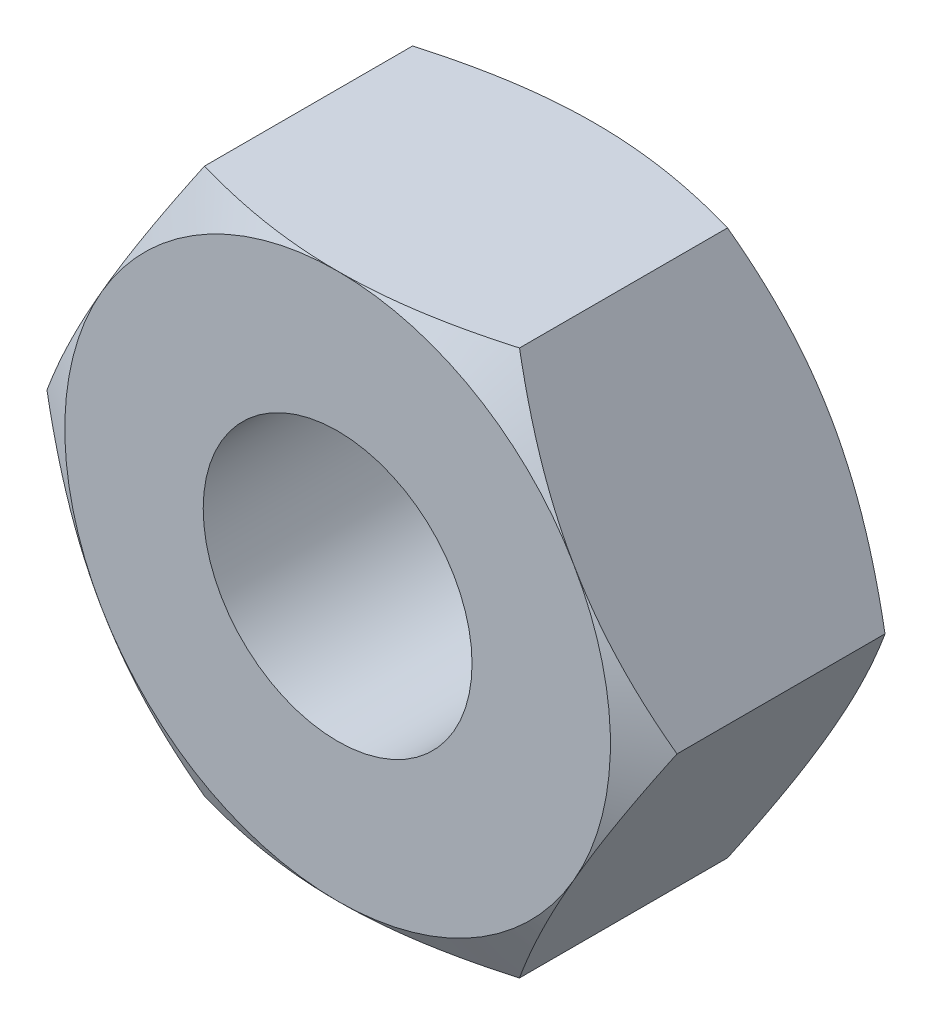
ISO-10303-21;
HEADER;
FILE_DESCRIPTION(('STEP AP214'),'2;1');
FILE_NAME('part.step','',(''),(''),'','','');
FILE_SCHEMA(('AUTOMOTIVE_DESIGN { 1 0 10303 214 1 1 1 1 }'));
ENDSEC;
DATA;
#1=APPLICATION_CONTEXT('core data for automotive mechanical design processes');
#2=APPLICATION_PROTOCOL_DEFINITION('international standard','automotive_design',2000,#1);
#3=PRODUCT_CONTEXT('',#1,'mechanical');
#4=PRODUCT('Part','Part','',(#3));
#5=PRODUCT_RELATED_PRODUCT_CATEGORY('part','',(#4));
#6=PRODUCT_DEFINITION_FORMATION('','',#4);
#7=PRODUCT_DEFINITION_CONTEXT('part definition',#1,'design');
#8=PRODUCT_DEFINITION('design','',#6,#7);
#9=PRODUCT_DEFINITION_SHAPE('','',#8);
#10=(LENGTH_UNIT() NAMED_UNIT(*) SI_UNIT(.MILLI.,.METRE.));
#11=(NAMED_UNIT(*) PLANE_ANGLE_UNIT() SI_UNIT($,.RADIAN.));
#12=(NAMED_UNIT(*) SI_UNIT($,.STERADIAN.) SOLID_ANGLE_UNIT());
#13=UNCERTAINTY_MEASURE_WITH_UNIT(LENGTH_MEASURE(1.E-05),#10,'distance_accuracy_value','');
#14=(GEOMETRIC_REPRESENTATION_CONTEXT(3) GLOBAL_UNCERTAINTY_ASSIGNED_CONTEXT((#13)) GLOBAL_UNIT_ASSIGNED_CONTEXT((#10,
#11,#12)) REPRESENTATION_CONTEXT('',''));
#15=CARTESIAN_POINT('',(0.,0.,0.));
#16=DIRECTION('',(0.,0.,1.));
#17=DIRECTION('',(1.,0.,0.));
#18=AXIS2_PLACEMENT_3D('',#15,#16,#17);
#19=CARTESIAN_POINT('',(0.,0.,-7.23625548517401));
#20=DIRECTION('',(0.,0.,1.));
#21=DIRECTION('',(0.,-1.,0.));
#22=AXIS2_PLACEMENT_3D('',#19,#20,#21);
#23=CONICAL_SURFACE('',#22,9.82284430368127,1.0471975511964);
#24=CARTESIAN_POINT('',(0.,8.5,-8.0000000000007));
#25=CARTESIAN_POINT('',(-0.208294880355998,8.5,-8.00003473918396));
#26=CARTESIAN_POINT('',(-0.416579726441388,8.5,-7.9955803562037));
#27=CARTESIAN_POINT('',(-0.832740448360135,8.5,-7.97795154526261));
#28=CARTESIAN_POINT('',(-1.04061639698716,8.5,-7.96477884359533));
#29=CARTESIAN_POINT('',(-1.4546166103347,8.5,-7.93005833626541));
#30=CARTESIAN_POINT('',(-1.66074443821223,8.5,-7.90855269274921));
#31=CARTESIAN_POINT('',(-2.07201802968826,8.5,-7.85762889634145));
#32=CARTESIAN_POINT('',(-2.27716376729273,8.5,-7.82821053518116));
#33=CARTESIAN_POINT('',(-2.89027749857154,8.5,-7.72899518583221));
#34=CARTESIAN_POINT('',(-3.29646437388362,8.5,-7.64818975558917));
#35=CARTESIAN_POINT('',(-4.10534509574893,8.5,-7.46183176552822));
#36=CARTESIAN_POINT('',(-4.50801072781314,8.5,-7.35615561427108));
#37=CARTESIAN_POINT('',(-4.90747728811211,8.5,-7.24081062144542));
#38=B_SPLINE_CURVE_WITH_KNOTS('',3,(#24,#25,#26,#27,#28,#29,#30,#31,#32,#33,#34,#35,#36,#37),
.UNSPECIFIED.,.F.,.F.,(4,2,2,2,2,2,4),(0.,0.624820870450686,1.24951805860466,1.87109489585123,
2.49268809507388,3.73424531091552,4.98210763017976),.UNSPECIFIED.);
#39=CARTESIAN_POINT('',(0.,8.50000000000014,-8.00000000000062));
#40=VERTEX_POINT('',#39);
#41=CARTESIAN_POINT('',(-4.90747728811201,8.50000000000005,-7.24081062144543));
#42=VERTEX_POINT('',#41);
#43=EDGE_CURVE('E145',#40,#42,#38,.T.);
#44=ORIENTED_EDGE('',*,*,#43,.F.);
#45=CARTESIAN_POINT('',(0.,0.,-8.00000000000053));
#46=DIRECTION('',(0.,0.,1.));
#47=DIRECTION('',(0.,-1.,0.));
#48=AXIS2_PLACEMENT_3D('',#45,#46,#47);
#49=CIRCLE('',#48,8.5000000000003);
#50=CARTESIAN_POINT('',(-7.36121593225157,4.24999999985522,-8.00000000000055));
#51=VERTEX_POINT('',#50);
#52=EDGE_CURVE('E147',#51,#40,#49,.F.);
#53=ORIENTED_EDGE('',*,*,#52,.F.);
#54=CARTESIAN_POINT('',(-4.90747728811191,8.50000000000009,-7.24081062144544));
#55=CARTESIAN_POINT('',(-5.10721056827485,8.1540518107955,-7.35615561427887));
#56=CARTESIAN_POINT('',(-5.30854338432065,7.80533314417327,-7.46183176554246));
#57=CARTESIAN_POINT('',(-5.71298374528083,7.10482189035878,-7.64818975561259));
#58=CARTESIAN_POINT('',(-5.91607718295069,6.75305373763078,-7.72899518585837));
#59=CARTESIAN_POINT('',(-6.22263404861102,6.22208167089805,-7.828210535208));
#60=CARTESIAN_POINT('',(-6.32520691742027,6.04442025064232,-7.85762889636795));
#61=CARTESIAN_POINT('',(-6.53084371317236,5.68824687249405,-7.90855269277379));
#62=CARTESIAN_POINT('',(-6.63390762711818,5.50973493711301,-7.93005833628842));
#63=CARTESIAN_POINT('',(-6.84090773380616,5.15120023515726,-7.96477884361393));
#64=CARTESIAN_POINT('',(-6.94484570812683,4.97117438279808,-7.97795154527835));
#65=CARTESIAN_POINT('',(-7.15292606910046,4.61076862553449,-7.99558035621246));
#66=CARTESIAN_POINT('',(-7.25706849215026,4.43038865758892,-8.00003473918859));
#67=CARTESIAN_POINT('',(-7.36121593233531,4.24999999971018,-8.00000000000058));
#68=B_SPLINE_CURVE_WITH_KNOTS('',3,(#54,#55,#56,#57,#58,#59,#60,#61,#62,#63,#64,#65,#66,#67),
.UNSPECIFIED.,.F.,.F.,(4,2,2,2,2,2,4),(0.,1.24786231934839,2.48941953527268,3.11101273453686,
3.73258957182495,4.35728676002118,4.98210763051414),.UNSPECIFIED.);
#69=EDGE_CURVE('E134',#42,#51,#68,.T.);
#70=ORIENTED_EDGE('',*,*,#69,.F.);
#71=EDGE_LOOP('',(#44,#53,#70));
#72=FACE_BOUND('',#71,.T.);
#73=ADVANCED_FACE('F41',(#72),#23,.T.);
#74=CARTESIAN_POINT('',(0.,0.,-7.23625548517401));
#75=DIRECTION('',(0.,0.,1.));
#76=DIRECTION('',(1.,0.,0.));
#77=AXIS2_PLACEMENT_3D('',#74,#75,#76);
#78=CONICAL_SURFACE('',#77,9.82284430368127,1.0471975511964);
#79=CARTESIAN_POINT('',(7.36121593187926,4.25000000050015,-8.00000000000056));
#80=CARTESIAN_POINT('',(7.25706849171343,4.4303886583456,-8.00003473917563));
#81=CARTESIAN_POINT('',(7.15292606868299,4.61076862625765,-7.99558035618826));
#82=CARTESIAN_POINT('',(6.94484570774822,4.97117438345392,-7.97795154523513));
#83=CARTESIAN_POINT('',(6.84090773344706,5.15120023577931,-7.96477884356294));
#84=CARTESIAN_POINT('',(6.6339076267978,5.50973493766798,-7.93005833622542));
#85=CARTESIAN_POINT('',(6.5308437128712,5.68824687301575,-7.90855269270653));
#86=CARTESIAN_POINT('',(6.32520691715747,6.04442025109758,-7.8576288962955));
#87=CARTESIAN_POINT('',(6.22263404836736,6.22208167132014,-7.82821053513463));
#88=CARTESIAN_POINT('',(5.91607718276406,6.7530537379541,-7.72899518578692));
#89=CARTESIAN_POINT('',(5.71298374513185,7.10482189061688,-7.64818975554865));
#90=CARTESIAN_POINT('',(5.30854338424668,7.80533314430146,-7.46183176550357));
#91=CARTESIAN_POINT('',(5.10721056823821,8.15405181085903,-7.35615561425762));
#92=CARTESIAN_POINT('',(4.90747728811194,8.5000000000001,-7.24081062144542));
#93=B_SPLINE_CURVE_WITH_KNOTS('',3,(#79,#80,#81,#82,#83,#84,#85,#86,#87,#88,#89,#90,#91,#92),
.UNSPECIFIED.,.F.,.F.,(4,2,2,2,2,2,4),(0.,0.62482087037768,1.24951805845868,1.87109489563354,
2.49268809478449,3.73424531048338,4.98210762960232),.UNSPECIFIED.);
#94=CARTESIAN_POINT('',(7.36121593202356,4.25000000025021,-8.00000000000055));
#95=VERTEX_POINT('',#94);
#96=CARTESIAN_POINT('',(4.90747728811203,8.50000000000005,-7.24081062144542));
#97=VERTEX_POINT('',#96);
#98=EDGE_CURVE('E211',#95,#97,#93,.T.);
#99=ORIENTED_EDGE('',*,*,#98,.F.);
#100=CARTESIAN_POINT('',(0.,0.,-8.00000000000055));
#101=DIRECTION('',(0.,0.,1.));
#102=DIRECTION('',(1.,0.,0.));
#103=AXIS2_PLACEMENT_3D('',#100,#101,#102);
#104=CIRCLE('',#103,8.50000000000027);
#105=EDGE_CURVE('E152',#40,#95,#104,.F.);
#106=ORIENTED_EDGE('',*,*,#105,.F.);
#107=CARTESIAN_POINT('',(4.90747728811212,8.5,-7.24081062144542));
#108=CARTESIAN_POINT('',(4.50801072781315,8.5,-7.35615561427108));
#109=CARTESIAN_POINT('',(4.10534509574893,8.5,-7.46183176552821));
#110=CARTESIAN_POINT('',(3.29646437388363,8.5,-7.64818975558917));
#111=CARTESIAN_POINT('',(2.89027749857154,8.5,-7.72899518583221));
#112=CARTESIAN_POINT('',(2.27716376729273,8.5,-7.82821053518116));
#113=CARTESIAN_POINT('',(2.07201802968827,8.5,-7.85762889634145));
#114=CARTESIAN_POINT('',(1.66074443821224,8.5,-7.9085526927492));
#115=CARTESIAN_POINT('',(1.45461661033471,8.5,-7.9300583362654));
#116=CARTESIAN_POINT('',(1.04061639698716,8.5,-7.96477884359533));
#117=CARTESIAN_POINT('',(0.832740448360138,8.5,-7.97795154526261));
#118=CARTESIAN_POINT('',(0.41657972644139,8.5,-7.99558035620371));
#119=CARTESIAN_POINT('',(0.208294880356,8.5,-8.00003473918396));
#120=CARTESIAN_POINT('',(0.,8.5,-8.0000000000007));
#121=B_SPLINE_CURVE_WITH_KNOTS('',3,(#107,#108,#109,#110,#111,#112,#113,#114,#115,#116,#117,
#118,#119,#120),.UNSPECIFIED.,.F.,.F.,(4,2,2,2,2,2,4),(0.,1.24786231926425,2.48941953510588,
3.11101273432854,3.73258957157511,4.35728675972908,4.98210763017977),.UNSPECIFIED.);
#122=EDGE_CURVE('E216',#97,#40,#121,.T.);
#123=ORIENTED_EDGE('',*,*,#122,.F.);
#124=EDGE_LOOP('',(#99,#106,#123));
#125=FACE_BOUND('',#124,.T.);
#126=ADVANCED_FACE('F572',(#125),#78,.T.);
#127=CARTESIAN_POINT('',(0.,0.,-7.23625548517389));
#128=DIRECTION('',(0.,0.,1.));
#129=DIRECTION('',(1.,0.,0.));
#130=AXIS2_PLACEMENT_3D('',#127,#128,#129);
#131=CONICAL_SURFACE('',#130,9.82284430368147,1.0471975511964);
#132=CARTESIAN_POINT('',(9.81495457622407,0.,-7.24081062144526));
#133=CARTESIAN_POINT('',(9.61522129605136,0.345948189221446,-7.35615561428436));
#134=CARTESIAN_POINT('',(9.41388847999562,0.694666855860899,-7.46183176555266));
#135=CARTESIAN_POINT('',(9.00944811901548,1.39517810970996,-7.64818975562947));
#136=CARTESIAN_POINT('',(8.8063546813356,1.74694626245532,-7.72899518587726));
#137=CARTESIAN_POINT('',(8.49979781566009,2.27791832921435,-7.82821053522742));
#138=CARTESIAN_POINT('',(8.39722494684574,2.4555797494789,-7.85762889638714));
#139=CARTESIAN_POINT('',(8.19158815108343,2.81175312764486,-7.90855269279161));
#140=CARTESIAN_POINT('',(8.08852423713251,2.99026506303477,-7.93005833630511));
#141=CARTESIAN_POINT('',(7.88152413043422,3.34879976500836,-7.96477884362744));
#142=CARTESIAN_POINT('',(7.77758615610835,3.52882561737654,-7.9779515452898));
#143=CARTESIAN_POINT('',(7.56950579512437,3.88923137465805,-7.99558035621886));
#144=CARTESIAN_POINT('',(7.46536337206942,4.06961134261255,-8.000034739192));
#145=CARTESIAN_POINT('',(7.36121593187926,4.25000000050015,-8.00000000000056));
#146=B_SPLINE_CURVE_WITH_KNOTS('',3,(#132,#133,#134,#135,#136,#137,#138,#139,#140,#141,#142,
#143,#144,#145),.UNSPECIFIED.,.F.,.F.,(4,2,2,2,2,2,4),(0.,1.24786231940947,2.48941953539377,
3.11101273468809,3.73258957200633,4.35728676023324,4.98210763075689),.UNSPECIFIED.);
#147=CARTESIAN_POINT('',(9.81495457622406,0.,-7.24081062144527));
#148=VERTEX_POINT('',#147);
#149=EDGE_CURVE('E210',#148,#95,#146,.T.);
#150=ORIENTED_EDGE('',*,*,#149,.F.);
#151=CARTESIAN_POINT('',(7.36121593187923,-4.25000000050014,-8.00000000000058));
#152=CARTESIAN_POINT('',(7.46536337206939,-4.06961134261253,-8.00003473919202));
#153=CARTESIAN_POINT('',(7.56950579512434,-3.88923137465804,-7.99558035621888));
#154=CARTESIAN_POINT('',(7.77758615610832,-3.52882561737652,-7.97795154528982));
#155=CARTESIAN_POINT('',(7.88152413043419,-3.34879976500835,-7.96477884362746));
#156=CARTESIAN_POINT('',(8.08852423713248,-2.99026506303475,-7.93005833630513));
#157=CARTESIAN_POINT('',(8.19158815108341,-2.81175312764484,-7.90855269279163));
#158=CARTESIAN_POINT('',(8.39722494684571,-2.45557974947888,-7.85762889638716));
#159=CARTESIAN_POINT('',(8.49979781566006,-2.27791832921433,-7.82821053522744));
#160=CARTESIAN_POINT('',(8.80635468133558,-1.7469462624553,-7.72899518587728));
#161=CARTESIAN_POINT('',(9.00944811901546,-1.39517810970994,-7.64818975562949));
#162=CARTESIAN_POINT('',(9.41388847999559,-0.694666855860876,-7.46183176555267));
#163=CARTESIAN_POINT('',(9.61522129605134,-0.345948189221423,-7.35615561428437));
#164=CARTESIAN_POINT('',(9.81495457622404,0.,-7.24081062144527));
#165=B_SPLINE_CURVE_WITH_KNOTS('',3,(#151,#152,#153,#154,#155,#156,#157,#158,#159,#160,#161,
#162,#163,#164),.UNSPECIFIED.,.F.,.F.,(4,2,2,2,2,2,4),(0.,0.624820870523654,1.24951805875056,
1.8710948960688,2.49268809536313,3.73424531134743,4.9821076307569),.UNSPECIFIED.);
#166=CARTESIAN_POINT('',(7.36121593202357,-4.25000000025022,-8.00000000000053));
#167=VERTEX_POINT('',#166);
#168=EDGE_CURVE('E441',#167,#148,#165,.T.);
#169=ORIENTED_EDGE('',*,*,#168,.F.);
#170=CARTESIAN_POINT('',(0.,0.,-8.00000000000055));
#171=DIRECTION('',(0.,0.,1.));
#172=DIRECTION('',(1.,0.,0.));
#173=AXIS2_PLACEMENT_3D('',#170,#171,#172);
#174=CIRCLE('',#173,8.50000000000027);
#175=EDGE_CURVE('E408',#95,#167,#174,.F.);
#176=ORIENTED_EDGE('',*,*,#175,.F.);
#177=EDGE_LOOP('',(#150,#169,#176));
#178=FACE_BOUND('',#177,.T.);
#179=ADVANCED_FACE('F569',(#178),#131,.T.);
#180=CARTESIAN_POINT('',(0.,0.,-7.23625548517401));
#181=DIRECTION('',(0.,0.,1.));
#182=DIRECTION('',(1.,0.,0.));
#183=AXIS2_PLACEMENT_3D('',#180,#181,#182);
#184=CONICAL_SURFACE('',#183,9.82284430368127,1.0471975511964);
#185=CARTESIAN_POINT('',(0.,-8.5,-8.0000000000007));
#186=CARTESIAN_POINT('',(0.208294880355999,-8.5,-8.00003473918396));
#187=CARTESIAN_POINT('',(0.416579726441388,-8.5,-7.99558035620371));
#188=CARTESIAN_POINT('',(0.832740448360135,-8.5,-7.97795154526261));
#189=CARTESIAN_POINT('',(1.04061639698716,-8.5,-7.96477884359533));
#190=CARTESIAN_POINT('',(1.4546166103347,-8.5,-7.9300583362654));
#191=CARTESIAN_POINT('',(1.66074443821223,-8.5,-7.90855269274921));
#192=CARTESIAN_POINT('',(2.07201802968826,-8.5,-7.85762889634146));
#193=CARTESIAN_POINT('',(2.27716376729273,-8.5,-7.82821053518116));
#194=CARTESIAN_POINT('',(2.89027749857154,-8.5,-7.72899518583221));
#195=CARTESIAN_POINT('',(3.29646437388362,-8.5,-7.64818975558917));
#196=CARTESIAN_POINT('',(4.10534509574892,-8.5,-7.46183176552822));
#197=CARTESIAN_POINT('',(4.50801072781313,-8.5,-7.35615561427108));
#198=CARTESIAN_POINT('',(4.90747728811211,-8.5,-7.24081062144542));
#199=B_SPLINE_CURVE_WITH_KNOTS('',3,(#185,#186,#187,#188,#189,#190,#191,#192,#193,#194,#195,
#196,#197,#198),.UNSPECIFIED.,.F.,.F.,(4,2,2,2,2,2,4),(0.,0.624820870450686,1.24951805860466,
1.87109489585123,2.49268809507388,3.73424531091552,4.98210763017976),.UNSPECIFIED.);
#200=CARTESIAN_POINT('',(0.,-8.50000000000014,-8.00000000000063));
#201=VERTEX_POINT('',#200);
#202=CARTESIAN_POINT('',(4.90747728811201,-8.50000000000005,-7.24081062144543));
#203=VERTEX_POINT('',#202);
#204=EDGE_CURVE('E424',#201,#203,#199,.T.);
#205=ORIENTED_EDGE('',*,*,#204,.F.);
#206=CARTESIAN_POINT('',(0.,0.,-8.00000000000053));
#207=DIRECTION('',(0.,0.,1.));
#208=DIRECTION('',(1.,0.,0.));
#209=AXIS2_PLACEMENT_3D('',#206,#207,#208);
#210=CIRCLE('',#209,8.5000000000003);
#211=EDGE_CURVE('E404',#167,#201,#210,.F.);
#212=ORIENTED_EDGE('',*,*,#211,.F.);
#213=CARTESIAN_POINT('',(4.90747728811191,-8.5000000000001,-7.24081062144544));
#214=CARTESIAN_POINT('',(5.10721056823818,-8.15405181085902,-7.35615561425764));
#215=CARTESIAN_POINT('',(5.30854338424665,-7.80533314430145,-7.46183176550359));
#216=CARTESIAN_POINT('',(5.71298374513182,-7.10482189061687,-7.64818975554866));
#217=CARTESIAN_POINT('',(5.91607718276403,-6.75305373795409,-7.72899518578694));
#218=CARTESIAN_POINT('',(6.22263404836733,-6.22208167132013,-7.82821053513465));
#219=CARTESIAN_POINT('',(6.32520691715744,-6.04442025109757,-7.85762889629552));
#220=CARTESIAN_POINT('',(6.53084371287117,-5.68824687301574,-7.90855269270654));
#221=CARTESIAN_POINT('',(6.63390762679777,-5.50973493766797,-7.93005833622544));
#222=CARTESIAN_POINT('',(6.84090773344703,-5.1512002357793,-7.96477884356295));
#223=CARTESIAN_POINT('',(6.94484570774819,-4.97117438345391,-7.97795154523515));
#224=CARTESIAN_POINT('',(7.15292606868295,-4.61076862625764,-7.99558035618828));
#225=CARTESIAN_POINT('',(7.25706849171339,-4.43038865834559,-8.00003473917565));
#226=CARTESIAN_POINT('',(7.36121593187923,-4.25000000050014,-8.00000000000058));
#227=B_SPLINE_CURVE_WITH_KNOTS('',3,(#213,#214,#215,#216,#217,#218,#219,#220,#221,#222,#223,
#224,#225,#226),.UNSPECIFIED.,.F.,.F.,(4,2,2,2,2,2,4),(0.,1.24786231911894,2.48941953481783,
3.11101273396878,3.73258957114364,4.35728675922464,4.98210762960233),.UNSPECIFIED.);
#228=EDGE_CURVE('E435',#203,#167,#227,.T.);
#229=ORIENTED_EDGE('',*,*,#228,.F.);
#230=EDGE_LOOP('',(#205,#212,#229));
#231=FACE_BOUND('',#230,.T.);
#232=ADVANCED_FACE('F538',(#231),#184,.T.);
#233=CARTESIAN_POINT('',(0.,0.,-7.23625548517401));
#234=DIRECTION('',(0.,0.,1.));
#235=DIRECTION('',(1.,0.,0.));
#236=AXIS2_PLACEMENT_3D('',#233,#234,#235);
#237=CONICAL_SURFACE('',#236,9.82284430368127,1.0471975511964);
#238=CARTESIAN_POINT('',(-7.36121593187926,-4.25000000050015,-8.00000000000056));
#239=CARTESIAN_POINT('',(-7.25706849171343,-4.4303886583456,-8.00003473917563));
#240=CARTESIAN_POINT('',(-7.15292606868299,-4.61076862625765,-7.99558035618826));
#241=CARTESIAN_POINT('',(-6.94484570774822,-4.97117438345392,-7.97795154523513));
#242=CARTESIAN_POINT('',(-6.84090773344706,-5.15120023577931,-7.96477884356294));
#243=CARTESIAN_POINT('',(-6.6339076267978,-5.50973493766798,-7.93005833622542));
#244=CARTESIAN_POINT('',(-6.5308437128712,-5.68824687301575,-7.90855269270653));
#245=CARTESIAN_POINT('',(-6.32520691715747,-6.04442025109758,-7.8576288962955));
#246=CARTESIAN_POINT('',(-6.22263404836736,-6.22208167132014,-7.82821053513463));
#247=CARTESIAN_POINT('',(-5.91607718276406,-6.7530537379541,-7.72899518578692));
#248=CARTESIAN_POINT('',(-5.71298374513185,-7.10482189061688,-7.64818975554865));
#249=CARTESIAN_POINT('',(-5.30854338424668,-7.80533314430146,-7.46183176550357));
#250=CARTESIAN_POINT('',(-5.10721056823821,-8.15405181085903,-7.35615561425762));
#251=CARTESIAN_POINT('',(-4.90747728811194,-8.50000000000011,-7.24081062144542));
#252=B_SPLINE_CURVE_WITH_KNOTS('',3,(#238,#239,#240,#241,#242,#243,#244,#245,#246,#247,#248,
#249,#250,#251),.UNSPECIFIED.,.F.,.F.,(4,2,2,2,2,2,4),(0.,0.624820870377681,1.24951805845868,
1.87109489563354,2.49268809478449,3.73424531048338,4.98210762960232),.UNSPECIFIED.);
#253=CARTESIAN_POINT('',(-7.36121593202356,-4.25000000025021,-8.00000000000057));
#254=VERTEX_POINT('',#253);
#255=CARTESIAN_POINT('',(-4.90747728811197,-8.50000000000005,-7.24081062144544));
#256=VERTEX_POINT('',#255);
#257=EDGE_CURVE('E432',#254,#256,#252,.T.);
#258=ORIENTED_EDGE('',*,*,#257,.F.);
#259=CARTESIAN_POINT('',(0.,0.,-8.00000000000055));
#260=DIRECTION('',(0.,0.,1.));
#261=DIRECTION('',(1.,0.,0.));
#262=AXIS2_PLACEMENT_3D('',#259,#260,#261);
#263=CIRCLE('',#262,8.50000000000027);
#264=EDGE_CURVE('E161',#201,#254,#263,.F.);
#265=ORIENTED_EDGE('',*,*,#264,.F.);
#266=CARTESIAN_POINT('',(-4.90747728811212,-8.5,-7.24081062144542));
#267=CARTESIAN_POINT('',(-4.50801072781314,-8.5,-7.35615561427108));
#268=CARTESIAN_POINT('',(-4.10534509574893,-8.5,-7.46183176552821));
#269=CARTESIAN_POINT('',(-3.29646437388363,-8.5,-7.64818975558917));
#270=CARTESIAN_POINT('',(-2.89027749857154,-8.5,-7.72899518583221));
#271=CARTESIAN_POINT('',(-2.27716376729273,-8.5,-7.82821053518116));
#272=CARTESIAN_POINT('',(-2.07201802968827,-8.5,-7.85762889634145));
#273=CARTESIAN_POINT('',(-1.66074443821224,-8.5,-7.9085526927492));
#274=CARTESIAN_POINT('',(-1.45461661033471,-8.5,-7.9300583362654));
#275=CARTESIAN_POINT('',(-1.04061639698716,-8.5,-7.96477884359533));
#276=CARTESIAN_POINT('',(-0.832740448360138,-8.5,-7.97795154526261));
#277=CARTESIAN_POINT('',(-0.416579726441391,-8.5,-7.99558035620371));
#278=CARTESIAN_POINT('',(-0.208294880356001,-8.5,-8.00003473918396));
#279=CARTESIAN_POINT('',(0.,-8.5,-8.0000000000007));
#280=B_SPLINE_CURVE_WITH_KNOTS('',3,(#266,#267,#268,#269,#270,#271,#272,#273,#274,#275,#276,
#277,#278,#279),.UNSPECIFIED.,.F.,.F.,(4,2,2,2,2,2,4),(0.,1.24786231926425,2.48941953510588,
3.11101273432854,3.73258957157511,4.35728675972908,4.98210763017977),.UNSPECIFIED.);
#281=EDGE_CURVE('E153',#256,#201,#280,.T.);
#282=ORIENTED_EDGE('',*,*,#281,.F.);
#283=EDGE_LOOP('',(#258,#265,#282));
#284=FACE_BOUND('',#283,.T.);
#285=ADVANCED_FACE('F535',(#284),#237,.T.);
#286=CARTESIAN_POINT('',(0.,0.,-7.23625548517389));
#287=DIRECTION('',(0.,0.,1.));
#288=DIRECTION('',(1.,0.,0.));
#289=AXIS2_PLACEMENT_3D('',#286,#287,#288);
#290=CONICAL_SURFACE('',#289,9.82284430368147,1.0471975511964);
#291=CARTESIAN_POINT('',(-9.81495457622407,0.,-7.24081062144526));
#292=CARTESIAN_POINT('',(-9.61522129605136,-0.345948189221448,-7.35615561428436));
#293=CARTESIAN_POINT('',(-9.41388847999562,-0.6946668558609,-7.46183176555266));
#294=CARTESIAN_POINT('',(-9.00944811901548,-1.39517810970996,-7.64818975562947));
#295=CARTESIAN_POINT('',(-8.8063546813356,-1.74694626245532,-7.72899518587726));
#296=CARTESIAN_POINT('',(-8.49979781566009,-2.27791832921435,-7.82821053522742));
#297=CARTESIAN_POINT('',(-8.39722494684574,-2.4555797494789,-7.85762889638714));
#298=CARTESIAN_POINT('',(-8.19158815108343,-2.81175312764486,-7.90855269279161));
#299=CARTESIAN_POINT('',(-8.08852423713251,-2.99026506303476,-7.93005833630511));
#300=CARTESIAN_POINT('',(-7.88152413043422,-3.34879976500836,-7.96477884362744));
#301=CARTESIAN_POINT('',(-7.77758615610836,-3.52882561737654,-7.9779515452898));
#302=CARTESIAN_POINT('',(-7.56950579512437,-3.88923137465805,-7.99558035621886));
#303=CARTESIAN_POINT('',(-7.46536337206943,-4.06961134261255,-8.000034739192));
#304=CARTESIAN_POINT('',(-7.36121593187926,-4.25000000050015,-8.00000000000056));
#305=B_SPLINE_CURVE_WITH_KNOTS('',3,(#291,#292,#293,#294,#295,#296,#297,#298,#299,#300,#301,
#302,#303,#304),.UNSPECIFIED.,.F.,.F.,(4,2,2,2,2,2,4),(0.,1.24786231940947,2.48941953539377,
3.11101273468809,3.73258957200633,4.35728676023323,4.98210763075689),.UNSPECIFIED.);
#306=CARTESIAN_POINT('',(-9.81495457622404,0.,-7.24081062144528));
#307=VERTEX_POINT('',#306);
#308=EDGE_CURVE('E169',#307,#254,#305,.T.);
#309=ORIENTED_EDGE('',*,*,#308,.F.);
#310=CARTESIAN_POINT('',(-7.36121593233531,4.24999999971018,-8.00000000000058));
#311=CARTESIAN_POINT('',(-7.46536337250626,4.06961134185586,-8.00003473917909));
#312=CARTESIAN_POINT('',(-7.56950579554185,3.88923137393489,-7.9955803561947));
#313=CARTESIAN_POINT('',(-7.77758615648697,3.5288256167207,-7.97795154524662));
#314=CARTESIAN_POINT('',(-7.88152413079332,3.34879976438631,-7.96477884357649));
#315=CARTESIAN_POINT('',(-8.08852423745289,2.99026506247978,-7.93005833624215));
#316=CARTESIAN_POINT('',(-8.1915881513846,2.81175312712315,-7.90855269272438));
#317=CARTESIAN_POINT('',(-8.39722494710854,2.45557974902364,-7.85762889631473));
#318=CARTESIAN_POINT('',(-8.49979781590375,2.27791832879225,-7.82821053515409));
#319=CARTESIAN_POINT('',(-8.80635468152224,1.74694626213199,-7.72899518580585));
#320=CARTESIAN_POINT('',(-9.00944811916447,1.39517810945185,-7.64818975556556));
#321=CARTESIAN_POINT('',(-9.4138884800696,0.694666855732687,-7.46183176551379));
#322=CARTESIAN_POINT('',(-9.61522129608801,0.345948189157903,-7.35615561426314));
#323=CARTESIAN_POINT('',(-9.81495457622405,0.,-7.24081062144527));
#324=B_SPLINE_CURVE_WITH_KNOTS('',3,(#310,#311,#312,#313,#314,#315,#316,#317,#318,#319,#320,
#321,#322,#323),.UNSPECIFIED.,.F.,.F.,(4,2,2,2,2,2,4),(0.,0.624820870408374,1.24951805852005,
1.87109489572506,2.49268809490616,3.73424531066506,4.98210762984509),.UNSPECIFIED.);
#325=EDGE_CURVE('E45',#51,#307,#324,.T.);
#326=ORIENTED_EDGE('',*,*,#325,.F.);
#327=CARTESIAN_POINT('',(0.,0.,-8.00000000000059));
#328=DIRECTION('',(0.,0.,1.));
#329=DIRECTION('',(1.,0.,0.));
#330=AXIS2_PLACEMENT_3D('',#327,#328,#329);
#331=CIRCLE('',#330,8.5000000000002);
#332=EDGE_CURVE('E157',#254,#51,#331,.F.);
#333=ORIENTED_EDGE('',*,*,#332,.F.);
#334=EDGE_LOOP('',(#309,#326,#333));
#335=FACE_BOUND('',#334,.T.);
#336=ADVANCED_FACE('F168',(#335),#290,.T.);
#337=CARTESIAN_POINT('',(-9.814954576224,0.,0.));
#338=DIRECTION('',(-0.866025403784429,0.500000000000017,0.));
#339=DIRECTION('',(-0.500000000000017,-0.866025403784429,0.));
#340=AXIS2_PLACEMENT_3D('',#337,#338,#339);
#341=PLANE('',#340);
#342=DIRECTION('',(0.,0.,1.));
#343=VECTOR('',#342,1.);
#344=CARTESIAN_POINT('',(-4.907477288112,8.5,0.));
#345=LINE('',#344,#343);
#346=CARTESIAN_POINT('',(-4.90747724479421,8.5,-0.759189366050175));
#347=VERTEX_POINT('',#346);
#348=EDGE_CURVE('E141',#42,#347,#345,.T.);
#349=ORIENTED_EDGE('',*,*,#348,.F.);
#350=ORIENTED_EDGE('',*,*,#69,.T.);
#351=ORIENTED_EDGE('',*,*,#325,.T.);
#352=DIRECTION('',(0.,0.,1.));
#353=VECTOR('',#352,1.);
#354=CARTESIAN_POINT('',(-9.81495457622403,0.,0.));
#355=LINE('',#354,#353);
#356=CARTESIAN_POINT('',(-9.81495456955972,1.15428806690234E-08,-0.75918937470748));
#357=VERTEX_POINT('',#356);
#358=EDGE_CURVE('E429',#357,#307,#355,.F.);
#359=ORIENTED_EDGE('',*,*,#358,.F.);
#360=CARTESIAN_POINT('',(-7.36121593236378,4.24999999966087,1.75481093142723E-13));
#361=CARTESIAN_POINT('',(-7.46536337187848,4.06961134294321,3.47391770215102E-05));
#362=CARTESIAN_POINT('',(-7.56950579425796,3.88923137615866,-0.00441964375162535));
#363=CARTESIAN_POINT('',(-7.77758615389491,3.52882562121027,-0.0220484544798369));
#364=CARTESIAN_POINT('',(-7.8815241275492,3.34879977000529,-0.035221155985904));
#365=CARTESIAN_POINT('',(-8.08852423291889,2.9902650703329,-0.0699416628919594));
#366=CARTESIAN_POINT('',(-8.19158814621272,2.81175313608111,-0.0914473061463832));
#367=CARTESIAN_POINT('',(-8.39722494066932,2.4555797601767,-0.1423711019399));
#368=CARTESIAN_POINT('',(-8.49979780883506,2.27791834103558,-0.171789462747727));
#369=CARTESIAN_POINT('',(-8.80635467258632,1.74694627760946,-0.271004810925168));
#370=CARTESIAN_POINT('',(-9.00944810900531,1.39517812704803,-0.351810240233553));
#371=CARTESIAN_POINT('',(-9.41388846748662,0.694666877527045,-0.538168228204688));
#372=CARTESIAN_POINT('',(-9.61522128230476,0.345948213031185,-0.643844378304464));
#373=CARTESIAN_POINT('',(-9.81495456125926,2.59196866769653E-08,-0.759189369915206));
#374=B_SPLINE_CURVE_WITH_KNOTS('',3,(#360,#361,#362,#363,#364,#365,#366,#367,#368,#369,#370,
#371,#372,#373),.UNSPECIFIED.,.F.,.F.,(4,2,2,2,2,2,4),(0.,0.624820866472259,1.24951805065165,
1.87109488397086,2.49268807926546,3.73424528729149,4.98210759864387),.UNSPECIFIED.);
#375=CARTESIAN_POINT('',(-7.3612159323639,4.24999999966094,0.));
#376=VERTEX_POINT('',#375);
#377=EDGE_CURVE('E166',#376,#357,#374,.T.);
#378=ORIENTED_EDGE('',*,*,#377,.F.);
#379=CARTESIAN_POINT('',(-4.90747724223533,8.50000000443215,-0.759189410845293));
#380=CARTESIAN_POINT('',(-5.10721054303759,8.1540518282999,-0.643844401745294));
#381=CARTESIAN_POINT('',(-5.30854336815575,7.80533316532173,-0.538168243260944));
#382=CARTESIAN_POINT('',(-5.71298373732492,7.10482191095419,-0.351810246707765));
#383=CARTESIAN_POINT('',(-5.91607717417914,6.75305375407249,-0.271004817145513));
#384=CARTESIAN_POINT('',(-6.22263404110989,6.22208168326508,-0.171789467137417));
#385=CARTESIAN_POINT('',(-6.32520691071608,6.04442026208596,-0.142371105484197));
#386=CARTESIAN_POINT('',(-6.53084370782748,5.68824688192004,-0.0914473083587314));
#387=CARTESIAN_POINT('',(-6.63390762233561,5.50973494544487,-0.0699416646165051));
#388=CARTESIAN_POINT('',(-6.84090773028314,5.15120024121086,-0.0352211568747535));
#389=CARTESIAN_POINT('',(-6.94484570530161,4.97117438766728,-0.0220484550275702));
#390=CARTESIAN_POINT('',(-7.15292606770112,4.61076862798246,-0.00441964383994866));
#391=CARTESIAN_POINT('',(-7.25706849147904,4.43038865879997,3.47392046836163E-05));
#392=CARTESIAN_POINT('',(-7.36121593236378,4.24999999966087,1.75898630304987E-13));
#393=B_SPLINE_CURVE_WITH_KNOTS('',3,(#379,#380,#381,#382,#383,#384,#385,#386,#387,#388,#389,
#390,#391,#392),.UNSPECIFIED.,.F.,.F.,(4,2,2,2,2,2,4),(0.,1.247862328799,2.48941955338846,
3.11101275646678,3.73258959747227,4.35728678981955,4.9821076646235),.UNSPECIFIED.);
#394=EDGE_CURVE('E391',#347,#376,#393,.T.);
#395=ORIENTED_EDGE('',*,*,#394,.F.);
#396=EDGE_LOOP('',(#349,#350,#351,#359,#378,#395));
#397=FACE_BOUND('',#396,.T.);
#398=ADVANCED_FACE('F136',(#397),#341,.T.);
#399=CARTESIAN_POINT('',(-4.907477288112,8.5,0.));
#400=DIRECTION('',(0.,1.,0.));
#401=DIRECTION('',(0.,0.,1.));
#402=AXIS2_PLACEMENT_3D('',#399,#400,#401);
#403=PLANE('',#402);
#404=DIRECTION('',(0.,0.,1.));
#405=VECTOR('',#404,1.);
#406=CARTESIAN_POINT('',(4.907477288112,8.5,0.));
#407=LINE('',#406,#405);
#408=CARTESIAN_POINT('',(4.9074773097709,8.4999999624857,-0.759189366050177));
#409=VERTEX_POINT('',#408);
#410=EDGE_CURVE('E206',#97,#409,#407,.T.);
#411=ORIENTED_EDGE('',*,*,#410,.F.);
#412=ORIENTED_EDGE('',*,*,#122,.T.);
#413=ORIENTED_EDGE('',*,*,#43,.T.);
#414=ORIENTED_EDGE('',*,*,#348,.T.);
#415=CARTESIAN_POINT('',(0.,8.5,3.01387035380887E-13));
#416=CARTESIAN_POINT('',(-0.208294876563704,8.5,3.4739181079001E-05));
#417=CARTESIAN_POINT('',(-0.416579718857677,8.5,-0.00441964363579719));
#418=CARTESIAN_POINT('',(-0.832740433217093,8.5,-0.0220484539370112));
#419=CARTESIAN_POINT('',(-1.04061637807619,8.5,-0.0352211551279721));
#420=CARTESIAN_POINT('',(-1.45461658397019,8.5,-0.0699416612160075));
#421=CARTESIAN_POINT('',(-1.66074440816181,8.5,-0.0914473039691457));
#422=CARTESIAN_POINT('',(-2.07201799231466,8.5,-0.142371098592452));
#423=CARTESIAN_POINT('',(-2.27716372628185,8.5,-0.171789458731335));
#424=CARTESIAN_POINT('',(-2.89027744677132,8.5,-0.271004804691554));
#425=CARTESIAN_POINT('',(-3.29646431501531,8.5,-0.351810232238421));
#426=CARTESIAN_POINT('',(-4.10534502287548,8.5,-0.538168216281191));
#427=CARTESIAN_POINT('',(-4.50801064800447,8.5,-0.643844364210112));
#428=CARTESIAN_POINT('',(-4.90747720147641,8.5,-0.759189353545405));
#429=B_SPLINE_CURVE_WITH_KNOTS('',3,(#415,#416,#417,#418,#419,#420,#421,#422,#423,#424,#425,
#426,#427,#428),.UNSPECIFIED.,.F.,.F.,(4,2,2,2,2,2,4),(0.,0.624820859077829,1.24951803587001,
1.87109486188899,2.49268804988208,3.73424524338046,4.98210754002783),.UNSPECIFIED.);
#430=CARTESIAN_POINT('',(0.,8.50000000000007,2.63775804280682E-13));
#431=VERTEX_POINT('',#430);
#432=EDGE_CURVE('E290',#431,#347,#429,.T.);
#433=ORIENTED_EDGE('',*,*,#432,.F.);
#434=CARTESIAN_POINT('',(4.90747731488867,8.49999996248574,-0.759189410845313));
#435=CARTESIAN_POINT('',(4.50801075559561,8.49999998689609,-0.643844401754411));
#436=CARTESIAN_POINT('',(4.10534512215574,8.49999999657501,-0.538168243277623));
#437=CARTESIAN_POINT('',(3.29646439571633,8.50000000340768,-0.351810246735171));
#438=CARTESIAN_POINT('',(2.89027751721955,8.50000000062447,-0.271004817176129));
#439=CARTESIAN_POINT('',(2.27716378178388,8.49999999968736,-0.171789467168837));
#440=CARTESIAN_POINT('',(2.07201804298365,8.49999999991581,-0.142371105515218));
#441=CARTESIAN_POINT('',(1.66074444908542,8.50000000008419,-0.0914473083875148));
#442=CARTESIAN_POINT('',(1.4546166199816,8.50000000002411,-0.0699416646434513));
#443=CARTESIAN_POINT('',(1.04061640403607,8.49999999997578,-0.0352211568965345));
#444=CARTESIAN_POINT('',(0.832740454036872,8.49999999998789,-0.0220484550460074));
#445=CARTESIAN_POINT('',(0.416579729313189,8.50000000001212,-0.00441964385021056));
#446=CARTESIAN_POINT('',(0.208294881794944,8.50000000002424,3.47391992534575E-05));
#447=CARTESIAN_POINT('',(0.,8.5,3.01241267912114E-13));
#448=B_SPLINE_CURVE_WITH_KNOTS('',3,(#434,#435,#436,#437,#438,#439,#440,#441,#442,#443,#444,
#445,#446,#447),.UNSPECIFIED.,.F.,.F.,(4,2,2,2,2,2,4),(0.,1.24786232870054,2.48941955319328,
3.111012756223,3.7325895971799,4.35728678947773,4.98210766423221),.UNSPECIFIED.);
#449=EDGE_CURVE('E383',#409,#431,#448,.T.);
#450=ORIENTED_EDGE('',*,*,#449,.F.);
#451=EDGE_LOOP('',(#411,#412,#413,#414,#433,#450));
#452=FACE_BOUND('',#451,.T.);
#453=ADVANCED_FACE('F474',(#452),#403,.T.);
#454=CARTESIAN_POINT('',(4.907477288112,8.5,0.));
#455=DIRECTION('',(0.866025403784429,0.500000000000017,0.));
#456=DIRECTION('',(-0.500000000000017,0.866025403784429,0.));
#457=AXIS2_PLACEMENT_3D('',#454,#455,#456);
#458=PLANE('',#457);
#459=DIRECTION('',(0.,0.,1.));
#460=VECTOR('',#459,1.);
#461=CARTESIAN_POINT('',(9.814954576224,0.,0.));
#462=LINE('',#461,#460);
#463=CARTESIAN_POINT('',(9.8149545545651,-3.75143220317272E-08,-0.759189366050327));
#464=VERTEX_POINT('',#463);
#465=EDGE_CURVE('E212',#148,#464,#462,.T.);
#466=ORIENTED_EDGE('',*,*,#465,.F.);
#467=ORIENTED_EDGE('',*,*,#149,.T.);
#468=ORIENTED_EDGE('',*,*,#98,.T.);
#469=ORIENTED_EDGE('',*,*,#410,.T.);
#470=CARTESIAN_POINT('',(7.36121593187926,4.25000000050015,1.56311015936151E-13));
#471=CARTESIAN_POINT('',(7.25706849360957,4.43038865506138,3.47391727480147E-05));
#472=CARTESIAN_POINT('',(7.15292607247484,4.61076861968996,-0.00441964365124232));
#473=CARTESIAN_POINT('',(6.94484571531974,4.97117437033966,-0.0220484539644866));
#474=CARTESIAN_POINT('',(6.84090774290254,5.15120021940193,-0.0352211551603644));
#475=CARTESIAN_POINT('',(6.63390763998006,5.50973491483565,-0.0699416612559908));
#476=CARTESIAN_POINT('',(6.53084372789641,5.68824684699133,-0.0914473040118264));
#477=CARTESIAN_POINT('',(6.32520693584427,6.04442021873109,-0.142371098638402));
#478=CARTESIAN_POINT('',(6.2226340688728,6.22208163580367,-0.171789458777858));
#479=CARTESIAN_POINT('',(5.91607720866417,6.75305369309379,-0.271004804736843));
#480=CARTESIAN_POINT('',(5.71298377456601,7.10482183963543,-0.351810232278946));
#481=CARTESIAN_POINT('',(5.3085434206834,7.80533308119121,-0.538168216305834));
#482=CARTESIAN_POINT('',(5.10721060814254,8.1540517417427,-0.64384436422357));
#483=CARTESIAN_POINT('',(4.90747733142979,8.49999992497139,-0.759189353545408));
#484=B_SPLINE_CURVE_WITH_KNOTS('',3,(#470,#471,#472,#473,#474,#475,#476,#477,#478,#479,#480,
#481,#482,#483),.UNSPECIFIED.,.F.,.F.,(4,2,2,2,2,2,4),(0.,0.624820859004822,1.24951803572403,
1.87109486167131,2.49268804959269,3.73424524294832,4.98210753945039),.UNSPECIFIED.);
#485=CARTESIAN_POINT('',(7.36121593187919,4.25000000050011,2.01195681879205E-13));
#486=VERTEX_POINT('',#485);
#487=EDGE_CURVE('E387',#486,#409,#484,.T.);
#488=ORIENTED_EDGE('',*,*,#487,.F.);
#489=CARTESIAN_POINT('',(9.81495455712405,-4.1946348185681E-08,-0.759189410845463));
#490=CARTESIAN_POINT('',(9.61522129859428,0.34594815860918,-0.643844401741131));
#491=CARTESIAN_POINT('',(9.41388849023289,0.694666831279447,-0.538168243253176));
#492=CARTESIAN_POINT('',(9.00944813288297,1.39517809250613,-0.351810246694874));
#493=CARTESIAN_POINT('',(8.80635469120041,1.74694624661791,-0.27100481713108));
#494=CARTESIAN_POINT('',(8.49979782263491,2.27791831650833,-0.171789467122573));
#495=CARTESIAN_POINT('',(8.39722495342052,2.45557973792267,-0.142371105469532));
#496=CARTESIAN_POINT('',(8.19158815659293,2.8117531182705,-0.0914473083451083));
#497=CARTESIAN_POINT('',(8.08852424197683,2.99026505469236,-0.0699416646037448));
#498=CARTESIAN_POINT('',(7.88152413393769,3.34879975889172,-0.0352211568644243));
#499=CARTESIAN_POINT('',(7.77758615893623,3.52882561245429,-0.0220484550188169));
#500=CARTESIAN_POINT('',(7.56950579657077,3.88923137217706,-0.00441964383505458));
#501=CARTESIAN_POINT('',(7.46536337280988,4.0696113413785,3.47392072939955E-05));
#502=CARTESIAN_POINT('',(7.36121593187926,4.25000000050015,1.56188235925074E-13));
#503=B_SPLINE_CURVE_WITH_KNOTS('',3,(#489,#490,#491,#492,#493,#494,#495,#496,#497,#498,#499,
#500,#501,#502),.UNSPECIFIED.,.F.,.F.,(4,2,2,2,2,2,4),(0.,1.24786232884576,2.48941955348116,
3.11101275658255,3.73258959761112,4.35728678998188,4.98210766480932),.UNSPECIFIED.);
#504=EDGE_CURVE('E344',#464,#486,#503,.T.);
#505=ORIENTED_EDGE('',*,*,#504,.F.);
#506=EDGE_LOOP('',(#466,#467,#468,#469,#488,#505));
#507=FACE_BOUND('',#506,.T.);
#508=ADVANCED_FACE('F477',(#507),#458,.T.);
#509=CARTESIAN_POINT('',(9.814954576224,0.,0.));
#510=DIRECTION('',(0.866025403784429,-0.500000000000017,0.));
#511=DIRECTION('',(0.500000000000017,0.866025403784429,0.));
#512=AXIS2_PLACEMENT_3D('',#509,#510,#511);
#513=PLANE('',#512);
#514=DIRECTION('',(0.,0.,-1.));
#515=VECTOR('',#514,1.);
#516=CARTESIAN_POINT('',(4.907477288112,-8.5,0.));
#517=LINE('',#516,#515);
#518=CARTESIAN_POINT('',(4.90747724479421,-8.5,-0.759189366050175));
#519=VERTEX_POINT('',#518);
#520=EDGE_CURVE('E186',#203,#519,#517,.F.);
#521=ORIENTED_EDGE('',*,*,#520,.F.);
#522=ORIENTED_EDGE('',*,*,#228,.T.);
#523=ORIENTED_EDGE('',*,*,#168,.T.);
#524=ORIENTED_EDGE('',*,*,#465,.T.);
#525=CARTESIAN_POINT('',(7.36121593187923,-4.25000000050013,1.7521850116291E-13));
#526=CARTESIAN_POINT('',(7.46536337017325,-4.06961134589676,3.47391891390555E-05));
#527=CARTESIAN_POINT('',(7.56950579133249,-3.88923138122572,-0.00441964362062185));
#528=CARTESIAN_POINT('',(7.7775861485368,-3.52882563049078,-0.022048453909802));
#529=CARTESIAN_POINT('',(7.88152412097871,-3.34879978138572,-0.0352211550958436));
#530=CARTESIAN_POINT('',(8.08852422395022,-2.99026508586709,-0.0699416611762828));
#531=CARTESIAN_POINT('',(8.1915881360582,-2.81175315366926,-0.0914473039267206));
#532=CARTESIAN_POINT('',(8.39722492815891,-2.45557978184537,-0.142371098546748));
#533=CARTESIAN_POINT('',(8.49979779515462,-2.2779183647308,-0.171789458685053));
#534=CARTESIAN_POINT('',(8.80635465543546,-1.74694630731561,-0.27100480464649));
#535=CARTESIAN_POINT('',(9.0094480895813,-1.39517816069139,-0.351810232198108));
#536=CARTESIAN_POINT('',(9.41388844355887,-0.694666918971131,-0.538168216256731));
#537=CARTESIAN_POINT('',(9.61522125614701,-0.345948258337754,-0.643844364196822));
#538=CARTESIAN_POINT('',(9.81495453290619,-7.50286441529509E-08,-0.759189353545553));
#539=B_SPLINE_CURVE_WITH_KNOTS('',3,(#525,#526,#527,#528,#529,#530,#531,#532,#533,#534,#535,
#536,#537,#538),.UNSPECIFIED.,.F.,.F.,(4,2,2,2,2,2,4),(0.,0.624820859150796,1.24951803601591,
1.87109486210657,2.49268805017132,3.73424524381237,4.98210754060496),.UNSPECIFIED.);
#540=CARTESIAN_POINT('',(7.36121593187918,-4.2500000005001,2.11095985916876E-13));
#541=VERTEX_POINT('',#540);
#542=EDGE_CURVE('E342',#541,#464,#539,.T.);
#543=ORIENTED_EDGE('',*,*,#542,.F.);
#544=CARTESIAN_POINT('',(4.90747724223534,-8.50000000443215,-0.759189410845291));
#545=CARTESIAN_POINT('',(5.10721054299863,-8.15405182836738,-0.643844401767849));
#546=CARTESIAN_POINT('',(5.30854336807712,-7.80533316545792,-0.538168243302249));
#547=CARTESIAN_POINT('',(5.71298373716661,-7.10482191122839,-0.351810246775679));
#548=CARTESIAN_POINT('',(5.91607717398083,-6.75305375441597,-0.2710048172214));
#549=CARTESIAN_POINT('',(6.222634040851,-6.22208168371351,-0.171789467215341));
#550=CARTESIAN_POINT('',(6.32520691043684,-6.04442026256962,-0.142371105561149));
#551=CARTESIAN_POINT('',(6.53084370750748,-5.68824688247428,-0.0914473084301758));
#552=CARTESIAN_POINT('',(6.6339076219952,-5.50973494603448,-0.0699416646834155));
#553=CARTESIAN_POINT('',(6.84090772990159,-5.15120024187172,-0.0352211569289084));
#554=CARTESIAN_POINT('',(6.94484570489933,-4.97117438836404,-0.0220484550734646));
#555=CARTESIAN_POINT('',(7.15292606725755,-4.61076862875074,-0.00441964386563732));
#556=CARTESIAN_POINT('',(7.25706849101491,-4.43038865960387,3.47391909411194E-05));
#557=CARTESIAN_POINT('',(7.36121593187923,-4.25000000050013,1.75419384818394E-13));
#558=B_SPLINE_CURVE_WITH_KNOTS('',3,(#544,#545,#546,#547,#548,#549,#550,#551,#552,#553,#554,
#555,#556,#557),.UNSPECIFIED.,.F.,.F.,(4,2,2,2,2,2,4),(0.,1.24786232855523,2.48941955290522,
3.11101275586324,3.73258959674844,4.35728678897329,4.98210766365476),.UNSPECIFIED.);
#559=EDGE_CURVE('E244',#519,#541,#558,.T.);
#560=ORIENTED_EDGE('',*,*,#559,.F.);
#561=EDGE_LOOP('',(#521,#522,#523,#524,#543,#560));
#562=FACE_BOUND('',#561,.T.);
#563=ADVANCED_FACE('F264',(#562),#513,.T.);
#564=CARTESIAN_POINT('',(-4.907477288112,-8.5,0.));
#565=DIRECTION('',(-0.866025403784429,-0.500000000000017,0.));
#566=DIRECTION('',(0.500000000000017,-0.866025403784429,0.));
#567=AXIS2_PLACEMENT_3D('',#564,#565,#566);
#568=PLANE('',#567);
#569=ORIENTED_EDGE('',*,*,#358,.T.);
#570=ORIENTED_EDGE('',*,*,#308,.T.);
#571=ORIENTED_EDGE('',*,*,#257,.T.);
#572=DIRECTION('',(0.,0.,-1.));
#573=VECTOR('',#572,1.);
#574=CARTESIAN_POINT('',(-4.907477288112,-8.5,0.));
#575=LINE('',#574,#573);
#576=CARTESIAN_POINT('',(-4.9074773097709,-8.4999999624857,-0.759189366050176));
#577=VERTEX_POINT('',#576);
#578=EDGE_CURVE('E181',#577,#256,#575,.T.);
#579=ORIENTED_EDGE('',*,*,#578,.F.);
#580=CARTESIAN_POINT('',(-7.36121593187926,-4.25000000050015,1.56070290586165E-13));
#581=CARTESIAN_POINT('',(-7.25706849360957,-4.43038865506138,3.47391727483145E-05));
#582=CARTESIAN_POINT('',(-7.15292607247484,-4.61076861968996,-0.00441964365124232));
#583=CARTESIAN_POINT('',(-6.94484571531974,-4.97117437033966,-0.0220484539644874));
#584=CARTESIAN_POINT('',(-6.84090774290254,-5.15120021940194,-0.0352211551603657));
#585=CARTESIAN_POINT('',(-6.63390763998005,-5.50973491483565,-0.0699416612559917));
#586=CARTESIAN_POINT('',(-6.53084372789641,-5.68824684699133,-0.0914473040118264));
#587=CARTESIAN_POINT('',(-6.32520693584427,-6.04442021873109,-0.142371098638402));
#588=CARTESIAN_POINT('',(-6.2226340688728,-6.22208163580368,-0.171789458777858));
#589=CARTESIAN_POINT('',(-5.91607720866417,-6.75305369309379,-0.271004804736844));
#590=CARTESIAN_POINT('',(-5.71298377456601,-7.10482183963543,-0.351810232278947));
#591=CARTESIAN_POINT('',(-5.3085434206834,-7.80533308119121,-0.538168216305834));
#592=CARTESIAN_POINT('',(-5.10721060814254,-8.1540517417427,-0.64384436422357));
#593=CARTESIAN_POINT('',(-4.90747733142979,-8.49999992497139,-0.759189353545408));
#594=B_SPLINE_CURVE_WITH_KNOTS('',3,(#580,#581,#582,#583,#584,#585,#586,#587,#588,#589,#590,
#591,#592,#593),.UNSPECIFIED.,.F.,.F.,(4,2,2,2,2,2,4),(0.,0.624820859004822,1.24951803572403,
1.8710948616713,2.49268804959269,3.73424524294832,4.98210753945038),.UNSPECIFIED.);
#595=CARTESIAN_POINT('',(-7.36121593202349,-4.25000000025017,2.4535495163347E-13));
#596=VERTEX_POINT('',#595);
#597=EDGE_CURVE('E234',#596,#577,#594,.T.);
#598=ORIENTED_EDGE('',*,*,#597,.F.);
#599=CARTESIAN_POINT('',(-9.81495454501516,-1.6541169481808E-08,-0.759189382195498));
#600=CARTESIAN_POINT('',(-9.61522127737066,-0.345948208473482,-0.643844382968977));
#601=CARTESIAN_POINT('',(-9.4138884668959,-0.694666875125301,-0.538168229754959));
#602=CARTESIAN_POINT('',(-9.00944811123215,-1.39517812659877,-0.3518102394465));
#603=CARTESIAN_POINT('',(-8.80635467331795,-1.74694627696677,-0.271004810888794));
#604=CARTESIAN_POINT('',(-8.49979780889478,-2.27791834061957,-0.171789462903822));
#605=CARTESIAN_POINT('',(-8.39722494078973,-2.45557975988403,-0.142371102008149));
#606=CARTESIAN_POINT('',(-8.19158814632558,-2.81175313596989,-0.0914473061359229));
#607=CARTESIAN_POINT('',(-8.08852423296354,-2.99026507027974,-0.0699416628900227));
#608=CARTESIAN_POINT('',(-7.88152412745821,-3.34879977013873,-0.0352211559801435));
#609=CARTESIAN_POINT('',(-7.77758615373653,-3.52882562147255,-0.022048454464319));
#610=CARTESIAN_POINT('',(-7.56950579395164,-3.8892313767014,-0.00441964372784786));
#611=CARTESIAN_POINT('',(-7.46536337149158,-4.06961134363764,3.4739198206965E-05));
#612=CARTESIAN_POINT('',(-7.36121593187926,-4.25000000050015,1.56214669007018E-13));
#613=B_SPLINE_CURVE_WITH_KNOTS('',3,(#599,#600,#601,#602,#603,#604,#605,#606,#607,#608,#609,
#610,#611,#612),.UNSPECIFIED.,.F.,.F.,(4,2,2,2,2,2,4),(0.,1.24786231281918,2.4894195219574,
3.11101271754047,3.73258955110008,4.35728673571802,4.98210760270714),.UNSPECIFIED.);
#614=EDGE_CURVE('E281',#357,#596,#613,.T.);
#615=ORIENTED_EDGE('',*,*,#614,.F.);
#616=EDGE_LOOP('',(#569,#570,#571,#579,#598,#615));
#617=FACE_BOUND('',#616,.T.);
#618=ADVANCED_FACE('F260',(#617),#568,.T.);
#619=CARTESIAN_POINT('',(4.907477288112,-8.5,0.));
#620=DIRECTION('',(0.,-1.,0.));
#621=DIRECTION('',(0.,0.,-1.));
#622=AXIS2_PLACEMENT_3D('',#619,#620,#621);
#623=PLANE('',#622);
#624=ORIENTED_EDGE('',*,*,#578,.T.);
#625=ORIENTED_EDGE('',*,*,#281,.T.);
#626=ORIENTED_EDGE('',*,*,#204,.T.);
#627=ORIENTED_EDGE('',*,*,#520,.T.);
#628=CARTESIAN_POINT('',(0.,-8.5,3.01375742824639E-13));
#629=CARTESIAN_POINT('',(0.208294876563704,-8.5,3.47391810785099E-05));
#630=CARTESIAN_POINT('',(0.416579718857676,-8.5,-0.00441964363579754));
#631=CARTESIAN_POINT('',(0.832740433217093,-8.5,-0.0220484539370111));
#632=CARTESIAN_POINT('',(1.0406163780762,-8.5,-0.0352211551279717));
#633=CARTESIAN_POINT('',(1.45461658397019,-8.5,-0.0699416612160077));
#634=CARTESIAN_POINT('',(1.66074440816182,-8.5,-0.0914473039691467));
#635=CARTESIAN_POINT('',(2.07201799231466,-8.5,-0.142371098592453));
#636=CARTESIAN_POINT('',(2.27716372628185,-8.5,-0.171789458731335));
#637=CARTESIAN_POINT('',(2.89027744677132,-8.5,-0.271004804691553));
#638=CARTESIAN_POINT('',(3.29646431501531,-8.5,-0.35181023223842));
#639=CARTESIAN_POINT('',(4.10534502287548,-8.5,-0.538168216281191));
#640=CARTESIAN_POINT('',(4.50801064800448,-8.5,-0.643844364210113));
#641=CARTESIAN_POINT('',(4.90747720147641,-8.5,-0.759189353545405));
#642=B_SPLINE_CURVE_WITH_KNOTS('',3,(#628,#629,#630,#631,#632,#633,#634,#635,#636,#637,#638,
#639,#640,#641),.UNSPECIFIED.,.F.,.F.,(4,2,2,2,2,2,4),(0.,0.624820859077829,1.24951803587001,
1.87109486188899,2.49268804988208,3.73424524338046,4.98210754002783),.UNSPECIFIED.);
#643=CARTESIAN_POINT('',(0.,-8.50000000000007,2.63748682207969E-13));
#644=VERTEX_POINT('',#643);
#645=EDGE_CURVE('E375',#644,#519,#642,.T.);
#646=ORIENTED_EDGE('',*,*,#645,.F.);
#647=CARTESIAN_POINT('',(-4.90747731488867,-8.49999996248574,-0.759189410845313));
#648=CARTESIAN_POINT('',(-4.5080107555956,-8.49999998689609,-0.643844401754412));
#649=CARTESIAN_POINT('',(-4.10534512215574,-8.49999999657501,-0.538168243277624));
#650=CARTESIAN_POINT('',(-3.29646439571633,-8.50000000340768,-0.351810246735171));
#651=CARTESIAN_POINT('',(-2.89027751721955,-8.50000000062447,-0.271004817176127));
#652=CARTESIAN_POINT('',(-2.27716378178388,-8.49999999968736,-0.171789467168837));
#653=CARTESIAN_POINT('',(-2.07201804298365,-8.49999999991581,-0.142371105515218));
#654=CARTESIAN_POINT('',(-1.66074444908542,-8.50000000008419,-0.0914473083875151));
#655=CARTESIAN_POINT('',(-1.4546166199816,-8.50000000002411,-0.0699416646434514));
#656=CARTESIAN_POINT('',(-1.04061640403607,-8.49999999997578,-0.0352211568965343));
#657=CARTESIAN_POINT('',(-0.83274045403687,-8.49999999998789,-0.0220484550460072));
#658=CARTESIAN_POINT('',(-0.416579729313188,-8.50000000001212,-0.00441964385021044));
#659=CARTESIAN_POINT('',(-0.208294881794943,-8.50000000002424,3.47391992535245E-05));
#660=CARTESIAN_POINT('',(0.,-8.5,3.01332791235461E-13));
#661=B_SPLINE_CURVE_WITH_KNOTS('',3,(#647,#648,#649,#650,#651,#652,#653,#654,#655,#656,#657,
#658,#659,#660),.UNSPECIFIED.,.F.,.F.,(4,2,2,2,2,2,4),(0.,1.24786232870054,2.48941955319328,
3.111012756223,3.7325895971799,4.35728678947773,4.98210766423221),.UNSPECIFIED.);
#662=EDGE_CURVE('E65',#577,#644,#661,.T.);
#663=ORIENTED_EDGE('',*,*,#662,.F.);
#664=EDGE_LOOP('',(#624,#625,#626,#627,#646,#663));
#665=FACE_BOUND('',#664,.T.);
#666=ADVANCED_FACE('F263',(#665),#623,.T.);
#667=CARTESIAN_POINT('',(0.,0.,-8.));
#668=DIRECTION('',(0.,0.,-1.));
#669=DIRECTION('',(-1.,0.,0.));
#670=AXIS2_PLACEMENT_3D('',#667,#668,#669);
#671=PLANE('',#670);
#672=CARTESIAN_POINT('',(0.,0.,-8.0000000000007));
#673=DIRECTION('',(0.,0.,1.));
#674=DIRECTION('',(1.,0.,0.));
#675=AXIS2_PLACEMENT_3D('',#672,#673,#674);
#676=CIRCLE('',#675,4.18812500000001);
#677=CARTESIAN_POINT('',(4.18812500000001,0.,-8.0000000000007));
#678=VERTEX_POINT('',#677);
#679=EDGE_CURVE('E171',#678,#678,#676,.T.);
#680=ORIENTED_EDGE('',*,*,#679,.T.);
#681=EDGE_LOOP('',(#680));
#682=FACE_BOUND('',#681,.T.);
#683=ORIENTED_EDGE('',*,*,#264,.T.);
#684=ORIENTED_EDGE('',*,*,#332,.T.);
#685=ORIENTED_EDGE('',*,*,#52,.T.);
#686=ORIENTED_EDGE('',*,*,#105,.T.);
#687=ORIENTED_EDGE('',*,*,#175,.T.);
#688=ORIENTED_EDGE('',*,*,#211,.T.);
#689=EDGE_LOOP('',(#683,#684,#685,#686,#687,#688));
#690=FACE_BOUND('',#689,.T.);
#691=ADVANCED_FACE('F158',(#682,#690),#671,.T.);
#692=CARTESIAN_POINT('',(0.,0.,-0.763744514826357));
#693=DIRECTION('',(0.,0.,-1.));
#694=DIRECTION('',(-1.,0.,0.));
#695=AXIS2_PLACEMENT_3D('',#692,#693,#694);
#696=CONICAL_SURFACE('',#695,9.82284430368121,1.0471975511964);
#697=ORIENTED_EDGE('',*,*,#614,.T.);
#698=CARTESIAN_POINT('',(0.,0.,2.4535495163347E-13));
#699=DIRECTION('',(0.,0.,-1.));
#700=DIRECTION('',(-1.,0.,0.));
#701=AXIS2_PLACEMENT_3D('',#698,#699,#700);
#702=CIRCLE('',#701,8.5000000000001);
#703=EDGE_CURVE('E356',#596,#376,#702,.T.);
#704=ORIENTED_EDGE('',*,*,#703,.T.);
#705=ORIENTED_EDGE('',*,*,#377,.T.);
#706=EDGE_LOOP('',(#697,#704,#705));
#707=FACE_BOUND('',#706,.T.);
#708=ADVANCED_FACE('F303',(#707),#696,.T.);
#709=CARTESIAN_POINT('',(0.,0.,-0.763744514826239));
#710=DIRECTION('',(0.,0.,-1.));
#711=DIRECTION('',(0.,1.,0.));
#712=AXIS2_PLACEMENT_3D('',#709,#710,#711);
#713=CONICAL_SURFACE('',#712,9.82284430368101,1.0471975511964);
#714=ORIENTED_EDGE('',*,*,#394,.T.);
#715=CARTESIAN_POINT('',(0.,0.,0.));
#716=DIRECTION('',(0.,0.,-1.));
#717=DIRECTION('',(0.,1.,0.));
#718=AXIS2_PLACEMENT_3D('',#715,#716,#717);
#719=CIRCLE('',#718,8.50000000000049);
#720=EDGE_CURVE('E350',#376,#431,#719,.T.);
#721=ORIENTED_EDGE('',*,*,#720,.T.);
#722=ORIENTED_EDGE('',*,*,#432,.T.);
#723=EDGE_LOOP('',(#714,#721,#722));
#724=FACE_BOUND('',#723,.T.);
#725=ADVANCED_FACE('F306',(#724),#713,.T.);
#726=CARTESIAN_POINT('',(0.,0.,-0.76374451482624));
#727=DIRECTION('',(0.,0.,-1.));
#728=DIRECTION('',(-1.,0.,0.));
#729=AXIS2_PLACEMENT_3D('',#726,#727,#728);
#730=CONICAL_SURFACE('',#729,9.82284430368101,1.0471975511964);
#731=ORIENTED_EDGE('',*,*,#449,.T.);
#732=CARTESIAN_POINT('',(0.,0.,2.26164573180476E-13));
#733=DIRECTION('',(0.,0.,-1.));
#734=DIRECTION('',(-1.,0.,0.));
#735=AXIS2_PLACEMENT_3D('',#732,#733,#734);
#736=CIRCLE('',#735,8.50000000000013);
#737=EDGE_CURVE('E347',#431,#486,#736,.T.);
#738=ORIENTED_EDGE('',*,*,#737,.T.);
#739=ORIENTED_EDGE('',*,*,#487,.T.);
#740=EDGE_LOOP('',(#731,#738,#739));
#741=FACE_BOUND('',#740,.T.);
#742=ADVANCED_FACE('F497',(#741),#730,.T.);
#743=CARTESIAN_POINT('',(0.,0.,-0.763744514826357));
#744=DIRECTION('',(0.,0.,-1.));
#745=DIRECTION('',(-1.,0.,0.));
#746=AXIS2_PLACEMENT_3D('',#743,#744,#745);
#747=CONICAL_SURFACE('',#746,9.82284430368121,1.0471975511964);
#748=ORIENTED_EDGE('',*,*,#504,.T.);
#749=CARTESIAN_POINT('',(0.,0.,2.46330733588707E-13));
#750=DIRECTION('',(0.,0.,-1.));
#751=DIRECTION('',(-1.,0.,0.));
#752=AXIS2_PLACEMENT_3D('',#749,#750,#751);
#753=CIRCLE('',#752,8.5000000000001);
#754=EDGE_CURVE('E222',#486,#541,#753,.T.);
#755=ORIENTED_EDGE('',*,*,#754,.T.);
#756=ORIENTED_EDGE('',*,*,#542,.T.);
#757=EDGE_LOOP('',(#748,#755,#756));
#758=FACE_BOUND('',#757,.T.);
#759=ADVANCED_FACE('F340',(#758),#747,.T.);
#760=CARTESIAN_POINT('',(0.,0.,-0.76374451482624));
#761=DIRECTION('',(0.,0.,-1.));
#762=DIRECTION('',(-1.,0.,0.));
#763=AXIS2_PLACEMENT_3D('',#760,#761,#762);
#764=CONICAL_SURFACE('',#763,9.82284430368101,1.0471975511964);
#765=ORIENTED_EDGE('',*,*,#559,.T.);
#766=CARTESIAN_POINT('',(0.,0.,2.46222313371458E-13));
#767=DIRECTION('',(0.,0.,-1.));
#768=DIRECTION('',(-1.,0.,0.));
#769=AXIS2_PLACEMENT_3D('',#766,#767,#768);
#770=CIRCLE('',#769,8.5000000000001);
#771=EDGE_CURVE('E58',#541,#644,#770,.T.);
#772=ORIENTED_EDGE('',*,*,#771,.T.);
#773=ORIENTED_EDGE('',*,*,#645,.T.);
#774=EDGE_LOOP('',(#765,#772,#773));
#775=FACE_BOUND('',#774,.T.);
#776=ADVANCED_FACE('F326',(#775),#764,.T.);
#777=CARTESIAN_POINT('',(0.,0.,-0.76374451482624));
#778=DIRECTION('',(0.,0.,-1.));
#779=DIRECTION('',(-1.,0.,0.));
#780=AXIS2_PLACEMENT_3D('',#777,#778,#779);
#781=CONICAL_SURFACE('',#780,9.82284430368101,1.0471975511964);
#782=ORIENTED_EDGE('',*,*,#662,.T.);
#783=CARTESIAN_POINT('',(0.,0.,2.26164573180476E-13));
#784=DIRECTION('',(0.,0.,-1.));
#785=DIRECTION('',(-1.,0.,0.));
#786=AXIS2_PLACEMENT_3D('',#783,#784,#785);
#787=CIRCLE('',#786,8.50000000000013);
#788=EDGE_CURVE('E12',#644,#596,#787,.T.);
#789=ORIENTED_EDGE('',*,*,#788,.T.);
#790=ORIENTED_EDGE('',*,*,#597,.T.);
#791=EDGE_LOOP('',(#782,#789,#790));
#792=FACE_BOUND('',#791,.T.);
#793=ADVANCED_FACE('F257',(#792),#781,.T.);
#794=CARTESIAN_POINT('',(0.,0.,0.));
#795=DIRECTION('',(0.,0.,-1.));
#796=DIRECTION('',(-1.,0.,0.));
#797=AXIS2_PLACEMENT_3D('',#794,#795,#796);
#798=PLANE('',#797);
#799=CARTESIAN_POINT('',(0.,0.,0.));
#800=DIRECTION('',(0.,0.,1.));
#801=DIRECTION('',(1.,0.,0.));
#802=AXIS2_PLACEMENT_3D('',#799,#800,#801);
#803=CIRCLE('',#802,4.18812500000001);
#804=CARTESIAN_POINT('',(4.18812500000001,0.,0.));
#805=VERTEX_POINT('',#804);
#806=EDGE_CURVE('E174',#805,#805,#803,.T.);
#807=ORIENTED_EDGE('',*,*,#806,.F.);
#808=EDGE_LOOP('',(#807));
#809=FACE_BOUND('',#808,.T.);
#810=ORIENTED_EDGE('',*,*,#771,.F.);
#811=ORIENTED_EDGE('',*,*,#754,.F.);
#812=ORIENTED_EDGE('',*,*,#737,.F.);
#813=ORIENTED_EDGE('',*,*,#720,.F.);
#814=ORIENTED_EDGE('',*,*,#703,.F.);
#815=ORIENTED_EDGE('',*,*,#788,.F.);
#816=EDGE_LOOP('',(#810,#811,#812,#813,#814,#815));
#817=FACE_BOUND('',#816,.T.);
#818=ADVANCED_FACE('F316',(#809,#817),#798,.F.);
#819=CARTESIAN_POINT('',(0.,0.,0.));
#820=DIRECTION('',(0.,0.,1.));
#821=DIRECTION('',(1.,0.,0.));
#822=AXIS2_PLACEMENT_3D('',#819,#820,#821);
#823=CYLINDRICAL_SURFACE('',#822,4.18812500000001);
#824=ORIENTED_EDGE('',*,*,#679,.F.);
#825=EDGE_LOOP('',(#824));
#826=FACE_BOUND('',#825,.T.);
#827=ORIENTED_EDGE('',*,*,#806,.T.);
#828=EDGE_LOOP('',(#827));
#829=FACE_BOUND('',#828,.T.);
#830=ADVANCED_FACE('F318',(#826,#829),#823,.F.);
#831=CLOSED_SHELL('',(#73,#126,#179,#232,#285,#336,#398,#453,#508,#563,#618,#666,#691,#708,#725,
#742,#759,#776,#793,#818,#830));
#832=MANIFOLD_SOLID_BREP('B2',#831);
#833=ADVANCED_BREP_SHAPE_REPRESENTATION('',(#18,#832),#14);
#834=SHAPE_DEFINITION_REPRESENTATION(#9,#833);
ENDSEC;
END-ISO-10303-21;
